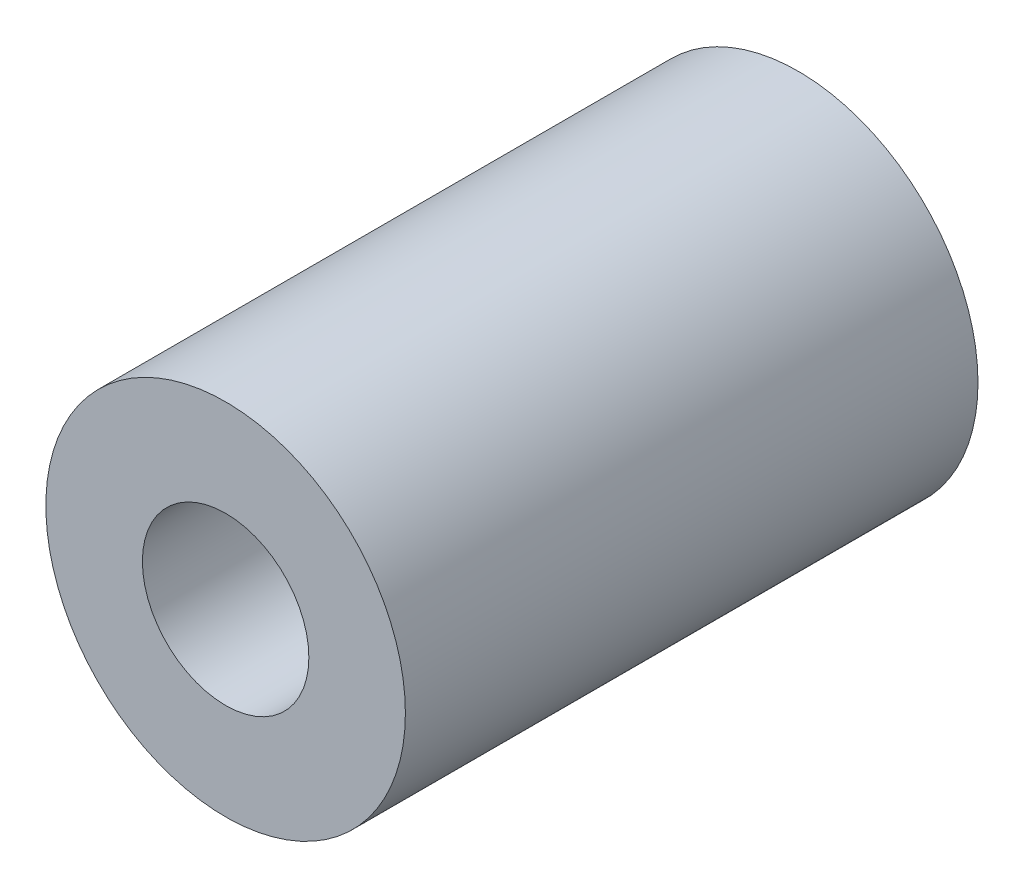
from build123d import *

# Parameters (mm, degrees)
SKETCH1_R          = 13.716
EXTRUDE1_DEPTH     = 43.688
SKETCH2_R          = 6.35
CUT_EXTRUDE1_DEPTH = 19.05
SKETCH3_R          = 4.7625
CUT_EXTRUDE2_DEPTH = 19.05


with BuildPart() as part:
    # Sketch1 → Extrude1 (new body)
    with BuildSketch(Plane.XY):
        Circle(SKETCH1_R)
    extrude(amount=EXTRUDE1_DEPTH)

    # Sketch2 → Cut-Extrude1 (cut)
    with BuildSketch(Plane.XY.offset(43.688)):
        Circle(SKETCH2_R)
    extrude(amount=-CUT_EXTRUDE1_DEPTH, mode=Mode.SUBTRACT)

    # Sketch3 → Cut-Extrude2 (cut)
    with BuildSketch(Plane(origin=(0, 0, 0), x_dir=(-1, 0, 0), z_dir=(0, 0, -1))):
        Circle(SKETCH3_R)
    extrude(amount=-CUT_EXTRUDE2_DEPTH, mode=Mode.SUBTRACT)


solid = part.part
